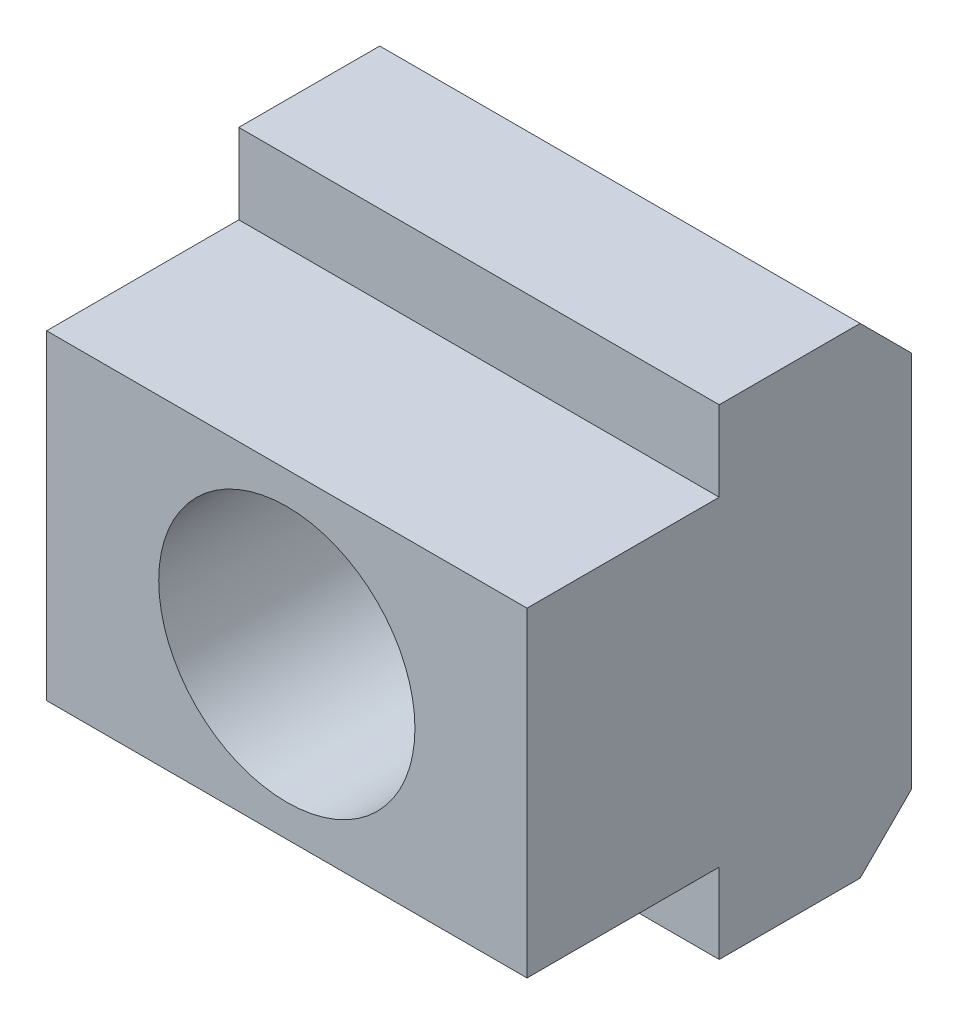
ISO-10303-21;
HEADER;
FILE_DESCRIPTION(('STEP AP214'),'2;1');
FILE_NAME('part.step','',(''),(''),'','','');
FILE_SCHEMA(('AUTOMOTIVE_DESIGN { 1 0 10303 214 1 1 1 1 }'));
ENDSEC;
DATA;
#1=APPLICATION_CONTEXT('core data for automotive mechanical design processes');
#2=APPLICATION_PROTOCOL_DEFINITION('international standard','automotive_design',2000,#1);
#3=PRODUCT_CONTEXT('',#1,'mechanical');
#4=PRODUCT('Part','Part','',(#3));
#5=PRODUCT_RELATED_PRODUCT_CATEGORY('part','',(#4));
#6=PRODUCT_DEFINITION_FORMATION('','',#4);
#7=PRODUCT_DEFINITION_CONTEXT('part definition',#1,'design');
#8=PRODUCT_DEFINITION('design','',#6,#7);
#9=PRODUCT_DEFINITION_SHAPE('','',#8);
#10=(LENGTH_UNIT() NAMED_UNIT(*) SI_UNIT(.MILLI.,.METRE.));
#11=(NAMED_UNIT(*) PLANE_ANGLE_UNIT() SI_UNIT($,.RADIAN.));
#12=(NAMED_UNIT(*) SI_UNIT($,.STERADIAN.) SOLID_ANGLE_UNIT());
#13=UNCERTAINTY_MEASURE_WITH_UNIT(LENGTH_MEASURE(1.E-05),#10,'distance_accuracy_value','');
#14=(GEOMETRIC_REPRESENTATION_CONTEXT(3) GLOBAL_UNCERTAINTY_ASSIGNED_CONTEXT((#13)) GLOBAL_UNIT_ASSIGNED_CONTEXT((#10,
#11,#12)) REPRESENTATION_CONTEXT('',''));
#15=CARTESIAN_POINT('',(0.,0.,0.));
#16=DIRECTION('',(0.,0.,1.));
#17=DIRECTION('',(1.,0.,0.));
#18=AXIS2_PLACEMENT_3D('',#15,#16,#17);
#19=CARTESIAN_POINT('',(7.5,5.,6.));
#20=DIRECTION('',(0.,0.,-1.));
#21=DIRECTION('',(0.,1.,0.));
#22=AXIS2_PLACEMENT_3D('',#19,#20,#21);
#23=PLANE('',#22);
#24=DIRECTION('',(-1.,0.,0.));
#25=VECTOR('',#24,1.);
#26=CARTESIAN_POINT('',(7.5,-5.,6.));
#27=LINE('',#26,#25);
#28=CARTESIAN_POINT('',(7.5,-5.,6.));
#29=VERTEX_POINT('',#28);
#30=CARTESIAN_POINT('',(-7.5,-5.,6.));
#31=VERTEX_POINT('',#30);
#32=EDGE_CURVE('E151',#29,#31,#27,.T.);
#33=ORIENTED_EDGE('',*,*,#32,.F.);
#34=DIRECTION('',(0.,-1.,0.));
#35=VECTOR('',#34,1.);
#36=CARTESIAN_POINT('',(7.5,5.,6.));
#37=LINE('',#36,#35);
#38=CARTESIAN_POINT('',(7.5,5.,6.));
#39=VERTEX_POINT('',#38);
#40=EDGE_CURVE('E130',#39,#29,#37,.T.);
#41=ORIENTED_EDGE('',*,*,#40,.F.);
#42=DIRECTION('',(-1.,0.,0.));
#43=VECTOR('',#42,1.);
#44=CARTESIAN_POINT('',(7.5,5.,6.));
#45=LINE('',#44,#43);
#46=CARTESIAN_POINT('',(-7.5,5.,6.));
#47=VERTEX_POINT('',#46);
#48=EDGE_CURVE('E153',#39,#47,#45,.T.);
#49=ORIENTED_EDGE('',*,*,#48,.T.);
#50=DIRECTION('',(0.,-1.,0.));
#51=VECTOR('',#50,1.);
#52=CARTESIAN_POINT('',(-7.5,5.,6.));
#53=LINE('',#52,#51);
#54=EDGE_CURVE('E181',#47,#31,#53,.T.);
#55=ORIENTED_EDGE('',*,*,#54,.T.);
#56=EDGE_LOOP('',(#33,#41,#49,#55));
#57=FACE_BOUND('',#56,.T.);
#58=CARTESIAN_POINT('',(0.,0.,6.));
#59=DIRECTION('',(0.,0.,1.));
#60=DIRECTION('',(0.,-1.,0.));
#61=AXIS2_PLACEMENT_3D('',#58,#59,#60);
#62=CIRCLE('',#61,4.);
#63=CARTESIAN_POINT('',(0.,-4.,6.));
#64=VERTEX_POINT('',#63);
#65=EDGE_CURVE('E105',#64,#64,#62,.T.);
#66=ORIENTED_EDGE('',*,*,#65,.F.);
#67=EDGE_LOOP('',(#66));
#68=FACE_BOUND('',#67,.T.);
#69=ADVANCED_FACE('F14',(#57,#68),#23,.F.);
#70=CARTESIAN_POINT('',(7.5,5.9,-6.));
#71=DIRECTION('',(0.,-0.707106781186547,0.707106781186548));
#72=DIRECTION('',(0.,-0.707106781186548,-0.707106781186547));
#73=AXIS2_PLACEMENT_3D('',#70,#71,#72);
#74=PLANE('',#73);
#75=DIRECTION('',(-1.,0.,0.));
#76=VECTOR('',#75,1.);
#77=CARTESIAN_POINT('',(7.5,7.5,-4.4));
#78=LINE('',#77,#76);
#79=CARTESIAN_POINT('',(7.5,7.5,-4.4));
#80=VERTEX_POINT('',#79);
#81=CARTESIAN_POINT('',(-7.5,7.5,-4.4));
#82=VERTEX_POINT('',#81);
#83=EDGE_CURVE('E9',#80,#82,#78,.T.);
#84=ORIENTED_EDGE('',*,*,#83,.F.);
#85=DIRECTION('',(0.,0.707106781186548,0.707106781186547));
#86=VECTOR('',#85,1.);
#87=CARTESIAN_POINT('',(7.5,5.9,-6.));
#88=LINE('',#87,#86);
#89=CARTESIAN_POINT('',(7.5,5.9,-6.));
#90=VERTEX_POINT('',#89);
#91=EDGE_CURVE('E140',#90,#80,#88,.T.);
#92=ORIENTED_EDGE('',*,*,#91,.F.);
#93=DIRECTION('',(-1.,0.,0.));
#94=VECTOR('',#93,1.);
#95=CARTESIAN_POINT('',(7.5,5.9,-6.));
#96=LINE('',#95,#94);
#97=CARTESIAN_POINT('',(-7.5,5.9,-6.));
#98=VERTEX_POINT('',#97);
#99=EDGE_CURVE('E29',#90,#98,#96,.T.);
#100=ORIENTED_EDGE('',*,*,#99,.T.);
#101=DIRECTION('',(0.,0.707106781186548,0.707106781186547));
#102=VECTOR('',#101,1.);
#103=CARTESIAN_POINT('',(-7.5,5.9,-6.));
#104=LINE('',#103,#102);
#105=EDGE_CURVE('E101',#98,#82,#104,.T.);
#106=ORIENTED_EDGE('',*,*,#105,.T.);
#107=EDGE_LOOP('',(#84,#92,#100,#106));
#108=FACE_BOUND('',#107,.T.);
#109=ADVANCED_FACE('F102',(#108),#74,.F.);
#110=CARTESIAN_POINT('',(7.5,7.5,-4.4));
#111=DIRECTION('',(0.,-1.,0.));
#112=DIRECTION('',(0.,0.,-1.));
#113=AXIS2_PLACEMENT_3D('',#110,#111,#112);
#114=PLANE('',#113);
#115=DIRECTION('',(-1.,0.,0.));
#116=VECTOR('',#115,1.);
#117=CARTESIAN_POINT('',(7.5,7.5,0.));
#118=LINE('',#117,#116);
#119=CARTESIAN_POINT('',(7.5,7.5,0.));
#120=VERTEX_POINT('',#119);
#121=CARTESIAN_POINT('',(-7.5,7.5,0.));
#122=VERTEX_POINT('',#121);
#123=EDGE_CURVE('E22',#120,#122,#118,.T.);
#124=ORIENTED_EDGE('',*,*,#123,.F.);
#125=DIRECTION('',(0.,0.,1.));
#126=VECTOR('',#125,1.);
#127=CARTESIAN_POINT('',(7.5,7.5,-4.4));
#128=LINE('',#127,#126);
#129=EDGE_CURVE('E97',#80,#120,#128,.T.);
#130=ORIENTED_EDGE('',*,*,#129,.F.);
#131=ORIENTED_EDGE('',*,*,#83,.T.);
#132=DIRECTION('',(0.,0.,1.));
#133=VECTOR('',#132,1.);
#134=CARTESIAN_POINT('',(-7.5,7.5,-4.4));
#135=LINE('',#134,#133);
#136=EDGE_CURVE('E94',#82,#122,#135,.T.);
#137=ORIENTED_EDGE('',*,*,#136,.T.);
#138=EDGE_LOOP('',(#124,#130,#131,#137));
#139=FACE_BOUND('',#138,.T.);
#140=ADVANCED_FACE('F16',(#139),#114,.F.);
#141=CARTESIAN_POINT('',(7.5,7.5,0.));
#142=DIRECTION('',(0.,0.,-1.));
#143=DIRECTION('',(0.,1.,0.));
#144=AXIS2_PLACEMENT_3D('',#141,#142,#143);
#145=PLANE('',#144);
#146=DIRECTION('',(-1.,0.,0.));
#147=VECTOR('',#146,1.);
#148=CARTESIAN_POINT('',(7.5,5.,0.));
#149=LINE('',#148,#147);
#150=CARTESIAN_POINT('',(7.5,5.,0.));
#151=VERTEX_POINT('',#150);
#152=CARTESIAN_POINT('',(-7.5,5.,0.));
#153=VERTEX_POINT('',#152);
#154=EDGE_CURVE('E155',#151,#153,#149,.T.);
#155=ORIENTED_EDGE('',*,*,#154,.F.);
#156=DIRECTION('',(0.,-1.,0.));
#157=VECTOR('',#156,1.);
#158=CARTESIAN_POINT('',(7.5,7.5,0.));
#159=LINE('',#158,#157);
#160=EDGE_CURVE('E136',#120,#151,#159,.T.);
#161=ORIENTED_EDGE('',*,*,#160,.F.);
#162=ORIENTED_EDGE('',*,*,#123,.T.);
#163=DIRECTION('',(0.,-1.,0.));
#164=VECTOR('',#163,1.);
#165=CARTESIAN_POINT('',(-7.5,7.5,0.));
#166=LINE('',#165,#164);
#167=EDGE_CURVE('E110',#122,#153,#166,.T.);
#168=ORIENTED_EDGE('',*,*,#167,.T.);
#169=EDGE_LOOP('',(#155,#161,#162,#168));
#170=FACE_BOUND('',#169,.T.);
#171=ADVANCED_FACE('F158',(#170),#145,.F.);
#172=CARTESIAN_POINT('',(7.5,5.,0.));
#173=DIRECTION('',(0.,-1.,0.));
#174=DIRECTION('',(0.,0.,-1.));
#175=AXIS2_PLACEMENT_3D('',#172,#173,#174);
#176=PLANE('',#175);
#177=ORIENTED_EDGE('',*,*,#48,.F.);
#178=DIRECTION('',(0.,0.,1.));
#179=VECTOR('',#178,1.);
#180=CARTESIAN_POINT('',(7.5,5.,0.));
#181=LINE('',#180,#179);
#182=EDGE_CURVE('E133',#151,#39,#181,.T.);
#183=ORIENTED_EDGE('',*,*,#182,.F.);
#184=ORIENTED_EDGE('',*,*,#154,.T.);
#185=DIRECTION('',(0.,0.,1.));
#186=VECTOR('',#185,1.);
#187=CARTESIAN_POINT('',(-7.5,5.,0.));
#188=LINE('',#187,#186);
#189=EDGE_CURVE('E112',#153,#47,#188,.T.);
#190=ORIENTED_EDGE('',*,*,#189,.T.);
#191=EDGE_LOOP('',(#177,#183,#184,#190));
#192=FACE_BOUND('',#191,.T.);
#193=ADVANCED_FACE('F186',(#192),#176,.F.);
#194=CARTESIAN_POINT('',(7.5,-5.,6.));
#195=DIRECTION('',(0.,1.,0.));
#196=DIRECTION('',(0.,0.,1.));
#197=AXIS2_PLACEMENT_3D('',#194,#195,#196);
#198=PLANE('',#197);
#199=DIRECTION('',(-1.,0.,0.));
#200=VECTOR('',#199,1.);
#201=CARTESIAN_POINT('',(7.5,-5.,0.));
#202=LINE('',#201,#200);
#203=CARTESIAN_POINT('',(7.5,-5.,0.));
#204=VERTEX_POINT('',#203);
#205=CARTESIAN_POINT('',(-7.5,-5.,0.));
#206=VERTEX_POINT('',#205);
#207=EDGE_CURVE('E149',#204,#206,#202,.T.);
#208=ORIENTED_EDGE('',*,*,#207,.F.);
#209=DIRECTION('',(0.,0.,-1.));
#210=VECTOR('',#209,1.);
#211=CARTESIAN_POINT('',(7.5,-5.,6.));
#212=LINE('',#211,#210);
#213=EDGE_CURVE('E127',#29,#204,#212,.T.);
#214=ORIENTED_EDGE('',*,*,#213,.F.);
#215=ORIENTED_EDGE('',*,*,#32,.T.);
#216=DIRECTION('',(0.,0.,-1.));
#217=VECTOR('',#216,1.);
#218=CARTESIAN_POINT('',(-7.5,-5.,6.));
#219=LINE('',#218,#217);
#220=EDGE_CURVE('E178',#31,#206,#219,.T.);
#221=ORIENTED_EDGE('',*,*,#220,.T.);
#222=EDGE_LOOP('',(#208,#214,#215,#221));
#223=FACE_BOUND('',#222,.T.);
#224=ADVANCED_FACE('F195',(#223),#198,.F.);
#225=CARTESIAN_POINT('',(7.5,-5.,0.));
#226=DIRECTION('',(0.,0.,-1.));
#227=DIRECTION('',(0.,1.,0.));
#228=AXIS2_PLACEMENT_3D('',#225,#226,#227);
#229=PLANE('',#228);
#230=DIRECTION('',(-1.,0.,0.));
#231=VECTOR('',#230,1.);
#232=CARTESIAN_POINT('',(7.5,-7.5,0.));
#233=LINE('',#232,#231);
#234=CARTESIAN_POINT('',(7.5,-7.5,0.));
#235=VERTEX_POINT('',#234);
#236=CARTESIAN_POINT('',(-7.5,-7.5,0.));
#237=VERTEX_POINT('',#236);
#238=EDGE_CURVE('E147',#235,#237,#233,.T.);
#239=ORIENTED_EDGE('',*,*,#238,.F.);
#240=DIRECTION('',(0.,-1.,0.));
#241=VECTOR('',#240,1.);
#242=CARTESIAN_POINT('',(7.5,-5.,0.));
#243=LINE('',#242,#241);
#244=EDGE_CURVE('E124',#204,#235,#243,.T.);
#245=ORIENTED_EDGE('',*,*,#244,.F.);
#246=ORIENTED_EDGE('',*,*,#207,.T.);
#247=DIRECTION('',(0.,-1.,0.));
#248=VECTOR('',#247,1.);
#249=CARTESIAN_POINT('',(-7.5,-5.,0.));
#250=LINE('',#249,#248);
#251=EDGE_CURVE('E175',#206,#237,#250,.T.);
#252=ORIENTED_EDGE('',*,*,#251,.T.);
#253=EDGE_LOOP('',(#239,#245,#246,#252));
#254=FACE_BOUND('',#253,.T.);
#255=ADVANCED_FACE('F197',(#254),#229,.F.);
#256=CARTESIAN_POINT('',(7.5,-7.5,0.));
#257=DIRECTION('',(0.,1.,0.));
#258=DIRECTION('',(0.,0.,1.));
#259=AXIS2_PLACEMENT_3D('',#256,#257,#258);
#260=PLANE('',#259);
#261=DIRECTION('',(-1.,0.,0.));
#262=VECTOR('',#261,1.);
#263=CARTESIAN_POINT('',(7.5,-7.5,-4.4));
#264=LINE('',#263,#262);
#265=CARTESIAN_POINT('',(7.5,-7.5,-4.4));
#266=VERTEX_POINT('',#265);
#267=CARTESIAN_POINT('',(-7.5,-7.5,-4.4));
#268=VERTEX_POINT('',#267);
#269=EDGE_CURVE('E145',#266,#268,#264,.T.);
#270=ORIENTED_EDGE('',*,*,#269,.F.);
#271=DIRECTION('',(0.,0.,-1.));
#272=VECTOR('',#271,1.);
#273=CARTESIAN_POINT('',(7.5,-7.5,0.));
#274=LINE('',#273,#272);
#275=EDGE_CURVE('E121',#235,#266,#274,.T.);
#276=ORIENTED_EDGE('',*,*,#275,.F.);
#277=ORIENTED_EDGE('',*,*,#238,.T.);
#278=DIRECTION('',(0.,0.,-1.));
#279=VECTOR('',#278,1.);
#280=CARTESIAN_POINT('',(-7.5,-7.5,0.));
#281=LINE('',#280,#279);
#282=EDGE_CURVE('E168',#237,#268,#281,.T.);
#283=ORIENTED_EDGE('',*,*,#282,.T.);
#284=EDGE_LOOP('',(#270,#276,#277,#283));
#285=FACE_BOUND('',#284,.T.);
#286=ADVANCED_FACE('F200',(#285),#260,.F.);
#287=CARTESIAN_POINT('',(7.5,-7.5,-4.4));
#288=DIRECTION('',(0.,0.707106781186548,0.707106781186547));
#289=DIRECTION('',(0.,-0.707106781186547,0.707106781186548));
#290=AXIS2_PLACEMENT_3D('',#287,#288,#289);
#291=PLANE('',#290);
#292=DIRECTION('',(-1.,0.,0.));
#293=VECTOR('',#292,1.);
#294=CARTESIAN_POINT('',(7.5,-5.9,-6.));
#295=LINE('',#294,#293);
#296=CARTESIAN_POINT('',(7.5,-5.9,-6.));
#297=VERTEX_POINT('',#296);
#298=CARTESIAN_POINT('',(-7.5,-5.9,-6.));
#299=VERTEX_POINT('',#298);
#300=EDGE_CURVE('E37',#297,#299,#295,.T.);
#301=ORIENTED_EDGE('',*,*,#300,.F.);
#302=DIRECTION('',(0.,0.707106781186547,-0.707106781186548));
#303=VECTOR('',#302,1.);
#304=CARTESIAN_POINT('',(7.5,-7.5,-4.4));
#305=LINE('',#304,#303);
#306=EDGE_CURVE('E119',#266,#297,#305,.T.);
#307=ORIENTED_EDGE('',*,*,#306,.F.);
#308=ORIENTED_EDGE('',*,*,#269,.T.);
#309=DIRECTION('',(0.,0.707106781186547,-0.707106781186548));
#310=VECTOR('',#309,1.);
#311=CARTESIAN_POINT('',(-7.5,-7.5,-4.4));
#312=LINE('',#311,#310);
#313=EDGE_CURVE('E164',#268,#299,#312,.T.);
#314=ORIENTED_EDGE('',*,*,#313,.T.);
#315=EDGE_LOOP('',(#301,#307,#308,#314));
#316=FACE_BOUND('',#315,.T.);
#317=ADVANCED_FACE('F165',(#316),#291,.F.);
#318=CARTESIAN_POINT('',(7.5,-5.9,-6.));
#319=DIRECTION('',(0.,0.,1.));
#320=DIRECTION('',(1.,0.,0.));
#321=AXIS2_PLACEMENT_3D('',#318,#319,#320);
#322=PLANE('',#321);
#323=CARTESIAN_POINT('',(0.,0.,-6.));
#324=DIRECTION('',(0.,0.,1.));
#325=DIRECTION('',(0.,-1.,0.));
#326=AXIS2_PLACEMENT_3D('',#323,#324,#325);
#327=CIRCLE('',#326,4.);
#328=CARTESIAN_POINT('',(0.,-4.,-6.));
#329=VERTEX_POINT('',#328);
#330=EDGE_CURVE('E319',#329,#329,#327,.T.);
#331=ORIENTED_EDGE('',*,*,#330,.T.);
#332=EDGE_LOOP('',(#331));
#333=FACE_BOUND('',#332,.T.);
#334=DIRECTION('',(0.,1.,0.));
#335=VECTOR('',#334,1.);
#336=CARTESIAN_POINT('',(7.5,-5.9,-6.));
#337=LINE('',#336,#335);
#338=EDGE_CURVE('E116',#297,#90,#337,.T.);
#339=ORIENTED_EDGE('',*,*,#338,.F.);
#340=ORIENTED_EDGE('',*,*,#300,.T.);
#341=DIRECTION('',(0.,1.,0.));
#342=VECTOR('',#341,1.);
#343=CARTESIAN_POINT('',(-7.5,-5.9,-6.));
#344=LINE('',#343,#342);
#345=EDGE_CURVE('E142',#299,#98,#344,.T.);
#346=ORIENTED_EDGE('',*,*,#345,.T.);
#347=ORIENTED_EDGE('',*,*,#99,.F.);
#348=EDGE_LOOP('',(#339,#340,#346,#347));
#349=FACE_BOUND('',#348,.T.);
#350=ADVANCED_FACE('F162',(#333,#349),#322,.F.);
#351=CARTESIAN_POINT('',(7.5,0.,-11.9));
#352=DIRECTION('',(-1.,0.,0.));
#353=DIRECTION('',(0.,0.,1.));
#354=AXIS2_PLACEMENT_3D('',#351,#352,#353);
#355=PLANE('',#354);
#356=ORIENTED_EDGE('',*,*,#91,.T.);
#357=ORIENTED_EDGE('',*,*,#129,.T.);
#358=ORIENTED_EDGE('',*,*,#160,.T.);
#359=ORIENTED_EDGE('',*,*,#182,.T.);
#360=ORIENTED_EDGE('',*,*,#40,.T.);
#361=ORIENTED_EDGE('',*,*,#213,.T.);
#362=ORIENTED_EDGE('',*,*,#244,.T.);
#363=ORIENTED_EDGE('',*,*,#275,.T.);
#364=ORIENTED_EDGE('',*,*,#306,.T.);
#365=ORIENTED_EDGE('',*,*,#338,.T.);
#366=EDGE_LOOP('',(#356,#357,#358,#359,#360,#361,#362,#363,#364,#365));
#367=FACE_BOUND('',#366,.T.);
#368=ADVANCED_FACE('F160',(#367),#355,.F.);
#369=CARTESIAN_POINT('',(-7.5,0.,-11.9));
#370=DIRECTION('',(-1.,0.,0.));
#371=DIRECTION('',(0.,0.,1.));
#372=AXIS2_PLACEMENT_3D('',#369,#370,#371);
#373=PLANE('',#372);
#374=ORIENTED_EDGE('',*,*,#105,.F.);
#375=ORIENTED_EDGE('',*,*,#345,.F.);
#376=ORIENTED_EDGE('',*,*,#313,.F.);
#377=ORIENTED_EDGE('',*,*,#282,.F.);
#378=ORIENTED_EDGE('',*,*,#251,.F.);
#379=ORIENTED_EDGE('',*,*,#220,.F.);
#380=ORIENTED_EDGE('',*,*,#54,.F.);
#381=ORIENTED_EDGE('',*,*,#189,.F.);
#382=ORIENTED_EDGE('',*,*,#167,.F.);
#383=ORIENTED_EDGE('',*,*,#136,.F.);
#384=EDGE_LOOP('',(#374,#375,#376,#377,#378,#379,#380,#381,#382,#383));
#385=FACE_BOUND('',#384,.T.);
#386=ADVANCED_FACE('F107',(#385),#373,.T.);
#387=CARTESIAN_POINT('',(0.,0.,6.));
#388=DIRECTION('',(0.,0.,1.));
#389=DIRECTION('',(0.,-1.,0.));
#390=AXIS2_PLACEMENT_3D('',#387,#388,#389);
#391=CYLINDRICAL_SURFACE('',#390,4.);
#392=ORIENTED_EDGE('',*,*,#65,.T.);
#393=EDGE_LOOP('',(#392));
#394=FACE_BOUND('',#393,.T.);
#395=ORIENTED_EDGE('',*,*,#330,.F.);
#396=EDGE_LOOP('',(#395));
#397=FACE_BOUND('',#396,.T.);
#398=ADVANCED_FACE('F285',(#394,#397),#391,.F.);
#399=CLOSED_SHELL('',(#69,#109,#140,#171,#193,#224,#255,#286,#317,#350,#368,#386,#398));
#400=MANIFOLD_SOLID_BREP('B1',#399);
#401=ADVANCED_BREP_SHAPE_REPRESENTATION('',(#18,#400),#14);
#402=SHAPE_DEFINITION_REPRESENTATION(#9,#401);
ENDSEC;
END-ISO-10303-21;
